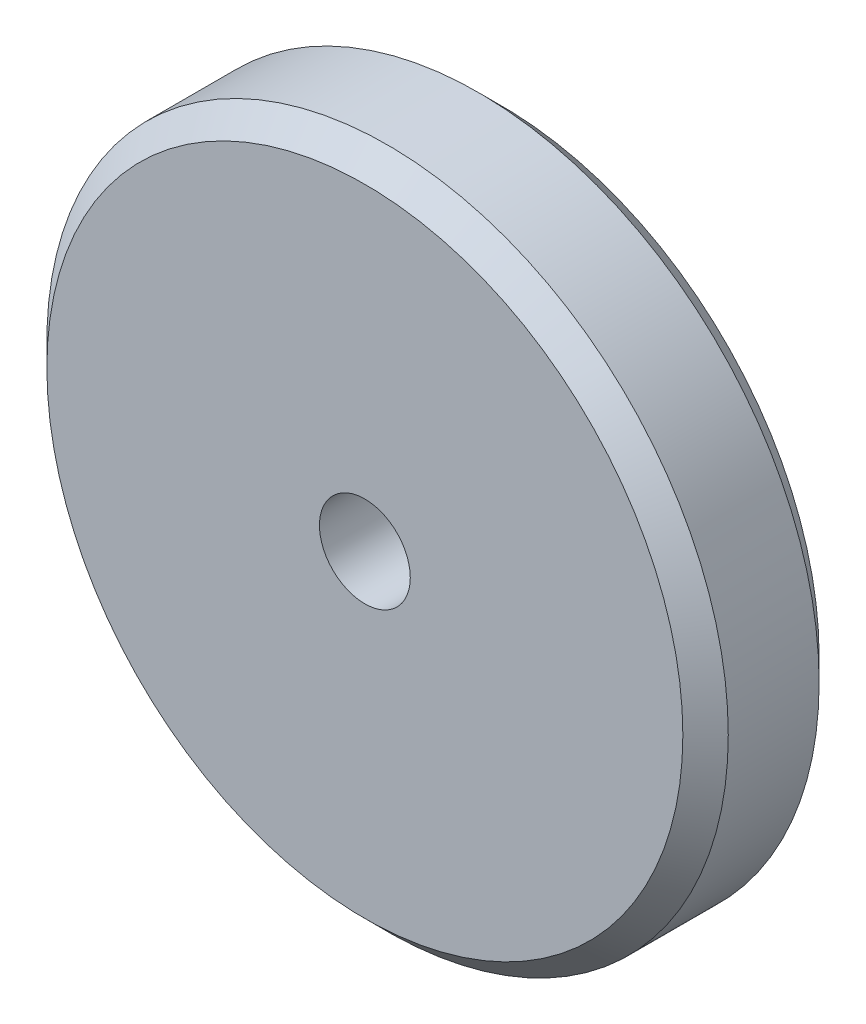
from build123d import *

# Parameters (mm, degrees)
SKETCH1_R      = 15
SKETCH1_R_2    = 2
EXTRUDE1_DEPTH = 6
CHAMFER1_SIZE  = 1


with BuildPart() as part:
    # Sketch1 → Extrude1 (new body)
    with BuildSketch(Plane.XY):
        Circle(SKETCH1_R)
        Circle(SKETCH1_R_2, mode=Mode.SUBTRACT)
    extrude(amount=EXTRUDE1_DEPTH)

    # Chamfer1
    chamfer1_edges = [part.edges().sort_by_distance(p)[0] for p in [
        (-15, 0, 0),
        (-15, 0, 6),
    ]]
    chamfer(chamfer1_edges, length=CHAMFER1_SIZE)


solid = part.part
